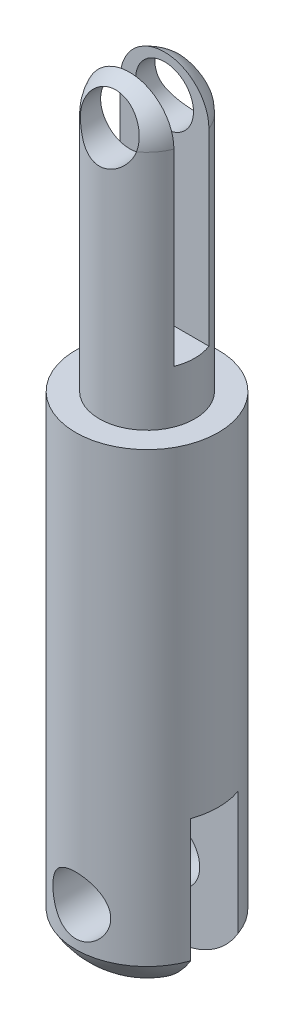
ISO-10303-21;
HEADER;
FILE_DESCRIPTION(('STEP AP214'),'2;1');
FILE_NAME('part.step','',(''),(''),'','','');
FILE_SCHEMA(('AUTOMOTIVE_DESIGN { 1 0 10303 214 1 1 1 1 }'));
ENDSEC;
DATA;
#1=APPLICATION_CONTEXT('core data for automotive mechanical design processes');
#2=APPLICATION_PROTOCOL_DEFINITION('international standard','automotive_design',2000,#1);
#3=PRODUCT_CONTEXT('',#1,'mechanical');
#4=PRODUCT('Part','Part','',(#3));
#5=PRODUCT_RELATED_PRODUCT_CATEGORY('part','',(#4));
#6=PRODUCT_DEFINITION_FORMATION('','',#4);
#7=PRODUCT_DEFINITION_CONTEXT('part definition',#1,'design');
#8=PRODUCT_DEFINITION('design','',#6,#7);
#9=PRODUCT_DEFINITION_SHAPE('','',#8);
#10=(LENGTH_UNIT() NAMED_UNIT(*) SI_UNIT(.MILLI.,.METRE.));
#11=(NAMED_UNIT(*) PLANE_ANGLE_UNIT() SI_UNIT($,.RADIAN.));
#12=(NAMED_UNIT(*) SI_UNIT($,.STERADIAN.) SOLID_ANGLE_UNIT());
#13=UNCERTAINTY_MEASURE_WITH_UNIT(LENGTH_MEASURE(1.E-05),#10,'distance_accuracy_value','');
#14=(GEOMETRIC_REPRESENTATION_CONTEXT(3) GLOBAL_UNCERTAINTY_ASSIGNED_CONTEXT((#13)) GLOBAL_UNIT_ASSIGNED_CONTEXT((#10,
#11,#12)) REPRESENTATION_CONTEXT('',''));
#15=CARTESIAN_POINT('',(0.,0.,0.));
#16=DIRECTION('',(0.,0.,1.));
#17=DIRECTION('',(1.,0.,0.));
#18=AXIS2_PLACEMENT_3D('',#15,#16,#17);
#19=CARTESIAN_POINT('',(0.,-27.1709821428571,0.));
#20=DIRECTION('',(0.,-1.,0.));
#21=DIRECTION('',(1.,0.,0.));
#22=AXIS2_PLACEMENT_3D('',#19,#20,#21);
#23=SPHERICAL_SURFACE('',#22,5.42901785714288);
#24=CARTESIAN_POINT('',(0.,-27.1709821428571,1.58));
#25=DIRECTION('',(0.,0.,1.));
#26=DIRECTION('',(0.,-1.,0.));
#27=AXIS2_PLACEMENT_3D('',#24,#25,#26);
#28=CIRCLE('',#27,5.19401914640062);
#29=CARTESIAN_POINT('',(4.47952006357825,-29.8,1.58));
#30=VERTEX_POINT('',#29);
#31=CARTESIAN_POINT('',(-4.47952006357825,-29.8,1.58));
#32=VERTEX_POINT('',#31);
#33=EDGE_CURVE('E142',#30,#32,#28,.F.);
#34=ORIENTED_EDGE('',*,*,#33,.F.);
#35=CARTESIAN_POINT('',(0.,-29.8,0.));
#36=DIRECTION('',(0.,-1.,0.));
#37=DIRECTION('',(1.,0.,0.));
#38=AXIS2_PLACEMENT_3D('',#35,#36,#37);
#39=CIRCLE('',#38,4.75000000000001);
#40=EDGE_CURVE('E258',#30,#32,#39,.T.);
#41=ORIENTED_EDGE('',*,*,#40,.T.);
#42=EDGE_LOOP('',(#34,#41));
#43=FACE_BOUND('',#42,.T.);
#44=ADVANCED_FACE('F34',(#43),#23,.T.);
#45=CARTESIAN_POINT('',(0.,-27.255,-4.75000000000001));
#46=DIRECTION('',(0.,0.,1.));
#47=DIRECTION('',(1.,0.,0.));
#48=AXIS2_PLACEMENT_3D('',#45,#46,#47);
#49=CYLINDRICAL_SURFACE('',#48,1.925);
#50=CARTESIAN_POINT('',(0.,-27.255,1.58));
#51=DIRECTION('',(0.,0.,1.));
#52=DIRECTION('',(0.,-1.,0.));
#53=AXIS2_PLACEMENT_3D('',#50,#51,#52);
#54=CIRCLE('',#53,1.925);
#55=CARTESIAN_POINT('',(0.,-29.18,1.58));
#56=VERTEX_POINT('',#55);
#57=EDGE_CURVE('E129',#56,#56,#54,.F.);
#58=ORIENTED_EDGE('',*,*,#57,.T.);
#59=EDGE_LOOP('',(#58));
#60=FACE_BOUND('',#59,.T.);
#61=CARTESIAN_POINT('',(1.925,-27.255,4.34245034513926));
#62=CARTESIAN_POINT('',(1.92498979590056,-27.152041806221,4.34246000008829));
#63=CARTESIAN_POINT('',(1.91668778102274,-27.0489042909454,4.34616503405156));
#64=CARTESIAN_POINT('',(1.88379264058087,-26.8455887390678,4.36051909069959));
#65=CARTESIAN_POINT('',(1.8591542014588,-26.7454197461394,4.37118742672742));
#66=CARTESIAN_POINT('',(1.7946866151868,-26.5513418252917,4.39804557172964));
#67=CARTESIAN_POINT('',(1.7549171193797,-26.4574099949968,4.41421367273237));
#68=CARTESIAN_POINT('',(1.66149068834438,-26.2775807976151,4.4502184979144));
#69=CARTESIAN_POINT('',(1.60783756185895,-26.1916812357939,4.47005421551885));
#70=CARTESIAN_POINT('',(1.48479243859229,-26.0252491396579,4.51246492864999));
#71=CARTESIAN_POINT('',(1.41471397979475,-25.9452467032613,4.5351295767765));
#72=CARTESIAN_POINT('',(1.26225061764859,-25.7977403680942,4.57990528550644));
#73=CARTESIAN_POINT('',(1.17986113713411,-25.730241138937,4.60201613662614));
#74=CARTESIAN_POINT('',(1.00100050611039,-25.6070060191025,4.64427256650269));
#75=CARTESIAN_POINT('',(0.904093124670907,-25.551859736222,4.66430174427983));
#76=CARTESIAN_POINT('',(0.701419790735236,-25.4588791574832,4.69904852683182));
#77=CARTESIAN_POINT('',(0.595657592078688,-25.4210375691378,4.7137683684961));
#78=CARTESIAN_POINT('',(0.383835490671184,-25.3656407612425,4.73560317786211));
#79=CARTESIAN_POINT('',(0.278049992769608,-25.3471732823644,4.74305881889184));
#80=CARTESIAN_POINT('',(0.0646364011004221,-25.3281082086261,4.75075843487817));
#81=CARTESIAN_POINT('',(-0.042990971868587,-25.3275037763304,4.75100516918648));
#82=CARTESIAN_POINT('',(-0.250426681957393,-25.3436887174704,4.74446437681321));
#83=CARTESIAN_POINT('',(-0.3503281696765,-25.359477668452,4.73808142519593));
#84=CARTESIAN_POINT('',(-0.545922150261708,-25.4062953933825,4.71954699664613));
#85=CARTESIAN_POINT('',(-0.641614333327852,-25.4373252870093,4.70739509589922));
#86=CARTESIAN_POINT('',(-0.827808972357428,-25.5141219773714,4.67827469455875));
#87=CARTESIAN_POINT('',(-0.918210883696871,-25.5601048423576,4.66123603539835));
#88=CARTESIAN_POINT('',(-1.09024990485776,-25.665296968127,4.62402568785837));
#89=CARTESIAN_POINT('',(-1.17188396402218,-25.7245108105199,4.60385291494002));
#90=CARTESIAN_POINT('',(-1.3298936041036,-25.8591169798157,4.56081498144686));
#91=CARTESIAN_POINT('',(-1.40554754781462,-25.9353289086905,4.53785998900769));
#92=CARTESIAN_POINT('',(-1.54330169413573,-26.0994361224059,4.49288129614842));
#93=CARTESIAN_POINT('',(-1.60539721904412,-26.1873354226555,4.47085791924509));
#94=CARTESIAN_POINT('',(-1.71598450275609,-26.3756326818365,4.42961549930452));
#95=CARTESIAN_POINT('',(-1.76401826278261,-26.4763239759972,4.41049897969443));
#96=CARTESIAN_POINT('',(-1.84215830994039,-26.6853472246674,4.37844239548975));
#97=CARTESIAN_POINT('',(-1.87227660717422,-26.7936740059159,4.36549819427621));
#98=CARTESIAN_POINT('',(-1.91195045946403,-27.0076833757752,4.34826258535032));
#99=CARTESIAN_POINT('',(-1.92267028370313,-27.1131101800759,4.34348230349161));
#100=CARTESIAN_POINT('',(-1.9266461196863,-27.3243416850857,4.34172139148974));
#101=CARTESIAN_POINT('',(-1.91990765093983,-27.4301462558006,4.34473829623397));
#102=CARTESIAN_POINT('',(-1.89021904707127,-27.6325488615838,4.35772903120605));
#103=CARTESIAN_POINT('',(-1.86825091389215,-27.7293213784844,4.3672810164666));
#104=CARTESIAN_POINT('',(-1.81000901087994,-27.9177379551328,4.39173741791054));
#105=CARTESIAN_POINT('',(-1.77373201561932,-28.0093808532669,4.40664304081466));
#106=CARTESIAN_POINT('',(-1.6862388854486,-28.1891444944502,4.44087662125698));
#107=CARTESIAN_POINT('',(-1.63446948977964,-28.2769651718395,4.46036130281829));
#108=CARTESIAN_POINT('',(-1.51802190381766,-28.4430796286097,4.50132369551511));
#109=CARTESIAN_POINT('',(-1.45333835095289,-28.5213694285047,4.5228022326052));
#110=CARTESIAN_POINT('',(-1.30708264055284,-28.6724030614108,4.56730809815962));
#111=CARTESIAN_POINT('',(-1.22459916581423,-28.7442697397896,4.59032873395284));
#112=CARTESIAN_POINT('',(-1.04819806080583,-28.8732844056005,4.63379142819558));
#113=CARTESIAN_POINT('',(-0.954279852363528,-28.9304316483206,4.65423335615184));
#114=CARTESIAN_POINT('',(-0.757245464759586,-29.0282175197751,4.69032019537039));
#115=CARTESIAN_POINT('',(-0.654123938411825,-29.0688464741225,4.70596229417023));
#116=CARTESIAN_POINT('',(-0.441717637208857,-29.1319029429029,4.73062243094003));
#117=CARTESIAN_POINT('',(-0.332436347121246,-29.1543406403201,4.73964417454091));
#118=CARTESIAN_POINT('',(-0.118676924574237,-29.1791461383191,4.74964188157));
#119=CARTESIAN_POINT('',(-0.0143647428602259,-29.1827530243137,4.75111446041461));
#120=CARTESIAN_POINT('',(0.193331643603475,-29.1730850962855,4.74719964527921));
#121=CARTESIAN_POINT('',(0.29671599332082,-29.1598129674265,4.74181334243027));
#122=CARTESIAN_POINT('',(0.496205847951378,-29.1176511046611,4.7250385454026));
#123=CARTESIAN_POINT('',(0.592438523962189,-29.0892776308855,4.71384875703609));
#124=CARTESIAN_POINT('',(0.778755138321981,-29.0182670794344,4.68667399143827));
#125=CARTESIAN_POINT('',(0.868837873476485,-28.9756272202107,4.67068807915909));
#126=CARTESIAN_POINT('',(1.0447128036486,-28.8751576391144,4.63459749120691));
#127=CARTESIAN_POINT('',(1.13013475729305,-28.8167355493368,4.61434098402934));
#128=CARTESIAN_POINT('',(1.29031886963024,-28.6872424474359,4.5721384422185));
#129=CARTESIAN_POINT('',(1.36507733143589,-28.616167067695,4.5501918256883));
#130=CARTESIAN_POINT('',(1.50675472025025,-28.4580332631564,4.50533699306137));
#131=CARTESIAN_POINT('',(1.57287082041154,-28.3702450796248,4.48245658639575));
#132=CARTESIAN_POINT('',(1.68952817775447,-28.1840770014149,4.4398050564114));
#133=CARTESIAN_POINT('',(1.74006096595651,-28.0856913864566,4.42003562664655));
#134=CARTESIAN_POINT('',(1.82342806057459,-27.8817195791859,4.38629992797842));
#135=CARTESIAN_POINT('',(1.85640671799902,-27.7762004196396,4.37228655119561));
#136=CARTESIAN_POINT('',(1.90377263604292,-27.5605714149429,4.35187822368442));
#137=CARTESIAN_POINT('',(1.91822227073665,-27.4504782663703,4.34545771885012));
#138=CARTESIAN_POINT('',(1.92437556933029,-27.3117481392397,4.34272581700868));
#139=CARTESIAN_POINT('',(1.92500281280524,-27.2833808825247,4.34244768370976));
#140=CARTESIAN_POINT('',(1.925,-27.255,4.34245034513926));
#141=B_SPLINE_CURVE_WITH_KNOTS('',3,(#61,#62,#63,#64,#65,#66,#67,#68,#69,#70,#71,#72,#73,#74,
#75,#76,#77,#78,#79,#80,#81,#82,#83,#84,#85,#86,#87,#88,#89,#90,#91,#92,#93,#94,#95,#96,#97,#98,
#99,#100,#101,#102,#103,#104,#105,#106,#107,#108,#109,#110,#111,#112,#113,#114,#115,#116,#117,
#118,#119,#120,#121,#122,#123,#124,#125,#126,#127,#128,#129,#130,#131,#132,#133,#134,#135,#136,
#137,#138,#139,#140),.UNSPECIFIED.,.T.,.F.,(4,2,2,2,2,2,2,2,2,2,2,2,2,2,2,2,2,2,2,2,2,2,2,2,2,2,
2,2,2,2,2,2,2,2,2,2,2,2,2,4),(0.,0.308796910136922,0.618453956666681,0.92690267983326,
1.23526687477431,1.56006696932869,1.88498812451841,2.22311526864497,2.56109978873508,
2.88233761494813,3.20345247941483,3.50606103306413,3.80869182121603,4.11590584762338,
4.42322642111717,4.7511917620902,5.07927007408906,5.41707700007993,5.75465721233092,
6.07120400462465,6.38765073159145,6.68538882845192,6.98319407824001,7.29325261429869,
7.60344017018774,7.93726343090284,8.27110357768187,8.60513896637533,8.93898724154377,
9.25056302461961,9.56208924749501,9.86359166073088,10.1651528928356,10.480156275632,
10.7952686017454,11.1304554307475,11.4658241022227,11.7983906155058,12.1298346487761,
12.2149558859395),.UNSPECIFIED.);
#142=CARTESIAN_POINT('',(1.925,-27.255,4.34245034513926));
#143=VERTEX_POINT('',#142);
#144=EDGE_CURVE('E202',#143,#143,#141,.T.);
#145=ORIENTED_EDGE('',*,*,#144,.T.);
#146=EDGE_LOOP('',(#145));
#147=FACE_BOUND('',#146,.T.);
#148=ADVANCED_FACE('F234',(#60,#147),#49,.F.);
#149=CARTESIAN_POINT('',(0.,16.025,0.));
#150=DIRECTION('',(0.,-1.,0.));
#151=DIRECTION('',(1.,0.,0.));
#152=AXIS2_PLACEMENT_3D('',#149,#150,#151);
#153=SPHERICAL_SURFACE('',#152,3.17500000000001);
#154=CARTESIAN_POINT('',(0.,16.025,1.165));
#155=DIRECTION('',(0.,0.,1.));
#156=DIRECTION('',(0.,-1.,0.));
#157=AXIS2_PLACEMENT_3D('',#154,#155,#156);
#158=CIRCLE('',#157,2.95354024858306);
#159=CARTESIAN_POINT('',(-2.95354024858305,16.025,1.165));
#160=VERTEX_POINT('',#159);
#161=CARTESIAN_POINT('',(2.95354024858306,16.025,1.165));
#162=VERTEX_POINT('',#161);
#163=EDGE_CURVE('E159',#160,#162,#158,.F.);
#164=ORIENTED_EDGE('',*,*,#163,.F.);
#165=CARTESIAN_POINT('',(0.,16.025,0.));
#166=DIRECTION('',(0.,-1.,0.));
#167=DIRECTION('',(1.,0.,0.));
#168=AXIS2_PLACEMENT_3D('',#165,#166,#167);
#169=CIRCLE('',#168,3.175);
#170=CARTESIAN_POINT('',(-1.86674181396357,16.025,2.56824843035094));
#171=VERTEX_POINT('',#170);
#172=EDGE_CURVE('E263',#171,#160,#169,.T.);
#173=ORIENTED_EDGE('',*,*,#172,.F.);
#174=CARTESIAN_POINT('',(1.86669144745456,16.0248,2.56828503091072));
#175=CARTESIAN_POINT('',(1.88016716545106,16.0783011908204,2.55849444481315));
#176=CARTESIAN_POINT('',(1.89132920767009,16.132328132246,2.54855115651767));
#177=CARTESIAN_POINT('',(1.90897692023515,16.2410898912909,2.52841389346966));
#178=CARTESIAN_POINT('',(1.91546296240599,16.2958246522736,2.51821993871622));
#179=CARTESIAN_POINT('',(1.92782323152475,16.4604150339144,2.48737422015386));
#180=CARTESIAN_POINT('',(1.92664237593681,16.5708276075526,2.46642738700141));
#181=CARTESIAN_POINT('',(1.90547891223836,16.7897752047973,2.42434624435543));
#182=CARTESIAN_POINT('',(1.8854904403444,16.898309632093,2.40321187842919));
#183=CARTESIAN_POINT('',(1.82727353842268,17.1104561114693,2.36135739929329));
#184=CARTESIAN_POINT('',(1.78904765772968,17.2140688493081,2.34063722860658));
#185=CARTESIAN_POINT('',(1.69530984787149,17.4135369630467,2.30023564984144));
#186=CARTESIAN_POINT('',(1.63977699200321,17.5093827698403,2.28055553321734));
#187=CARTESIAN_POINT('',(1.51290673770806,17.6903876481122,2.24294218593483));
#188=CARTESIAN_POINT('',(1.44156783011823,17.7755456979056,2.22500912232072));
#189=CARTESIAN_POINT('',(1.28585035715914,17.9317491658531,2.19176409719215));
#190=CARTESIAN_POINT('',(1.20161654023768,18.0029333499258,2.17642659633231));
#191=CARTESIAN_POINT('',(1.02190547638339,18.13006678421,2.14879706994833));
#192=CARTESIAN_POINT('',(0.926430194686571,18.1860186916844,2.13650451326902));
#193=CARTESIAN_POINT('',(0.7290481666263,18.2798835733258,2.11575415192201));
#194=CARTESIAN_POINT('',(0.627315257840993,18.3181456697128,2.10722230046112));
#195=CARTESIAN_POINT('',(0.418630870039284,18.3770529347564,2.09404258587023));
#196=CARTESIAN_POINT('',(0.311680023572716,18.3977002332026,2.08939425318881));
#197=CARTESIAN_POINT('',(0.0979420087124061,18.4204474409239,2.08427108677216));
#198=CARTESIAN_POINT('',(-0.00880391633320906,18.4229174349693,2.08371297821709));
#199=CARTESIAN_POINT('',(-0.221180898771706,18.4102072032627,2.08657786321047));
#200=CARTESIAN_POINT('',(-0.326812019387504,18.3950279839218,2.09000062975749));
#201=CARTESIAN_POINT('',(-0.533237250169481,18.3476798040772,2.10062096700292));
#202=CARTESIAN_POINT('',(-0.634059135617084,18.3156259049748,2.10779297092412));
#203=CARTESIAN_POINT('',(-0.828849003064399,18.2356098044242,2.12555994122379));
#204=CARTESIAN_POINT('',(-0.92281674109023,18.1876470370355,2.13615502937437));
#205=CARTESIAN_POINT('',(-1.10242983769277,18.0766281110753,2.16044394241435));
#206=CARTESIAN_POINT('',(-1.18796748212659,18.0134052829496,2.17417188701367));
#207=CARTESIAN_POINT('',(-1.34726195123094,17.8740266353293,2.20409580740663));
#208=CARTESIAN_POINT('',(-1.4210172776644,17.7978691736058,2.2202920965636));
#209=CARTESIAN_POINT('',(-1.55633593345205,17.6330062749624,2.25492345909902));
#210=CARTESIAN_POINT('',(-1.61760314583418,17.5440663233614,2.27339916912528));
#211=CARTESIAN_POINT('',(-1.72435650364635,17.3574267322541,2.31166277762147));
#212=CARTESIAN_POINT('',(-1.7698409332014,17.2597261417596,2.3314508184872));
#213=CARTESIAN_POINT('',(-1.84458660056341,17.0563273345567,2.37210311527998));
#214=CARTESIAN_POINT('',(-1.87352259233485,16.9505122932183,2.39298068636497));
#215=CARTESIAN_POINT('',(-1.91303481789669,16.7355358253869,2.43483761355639));
#216=CARTESIAN_POINT('',(-1.92361635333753,16.6263753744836,2.45581693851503));
#217=CARTESIAN_POINT('',(-1.92582563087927,16.4342820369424,2.49227249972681));
#218=CARTESIAN_POINT('',(-1.92141936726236,16.351392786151,2.50785222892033));
#219=CARTESIAN_POINT('',(-1.90198579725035,16.1868629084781,2.53850083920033));
#220=CARTESIAN_POINT('',(-1.88696930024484,16.1052210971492,2.55357022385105));
#221=CARTESIAN_POINT('',(-1.86669144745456,16.0248,2.56828503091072));
#222=B_SPLINE_CURVE_WITH_KNOTS('',3,(#174,#175,#176,#177,#178,#179,#180,#181,#182,#183,#184,
#185,#186,#187,#188,#189,#190,#191,#192,#193,#194,#195,#196,#197,#198,#199,#200,#201,#202,#203,
#204,#205,#206,#207,#208,#209,#210,#211,#212,#213,#214,#215,#216,#217,#218,#219,#220,#221),
.UNSPECIFIED.,.F.,.F.,(4,2,2,2,2,2,2,2,2,2,2,2,2,2,2,2,2,2,2,2,2,2,2,4),(0.,0.167997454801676,
0.335981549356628,0.671419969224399,1.0069630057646,1.34245915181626,1.67836254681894,
2.01429802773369,2.3467069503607,2.67905784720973,3.00453560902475,3.32997401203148,
3.64876776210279,3.96754333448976,4.28417293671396,4.60081380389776,4.92108333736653,
5.24139356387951,5.56858828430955,5.89581856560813,6.22927689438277,6.56263888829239,
6.81535443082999,7.06781288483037),.UNSPECIFIED.);
#223=CARTESIAN_POINT('',(1.86674181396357,16.025,2.56824843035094));
#224=VERTEX_POINT('',#223);
#225=EDGE_CURVE('E197',#224,#171,#222,.T.);
#226=ORIENTED_EDGE('',*,*,#225,.F.);
#227=EDGE_CURVE('E259',#162,#224,#169,.T.);
#228=ORIENTED_EDGE('',*,*,#227,.F.);
#229=EDGE_LOOP('',(#164,#173,#226,#228));
#230=FACE_BOUND('',#229,.T.);
#231=ADVANCED_FACE('F212',(#230),#153,.T.);
#232=CARTESIAN_POINT('',(0.,16.495,-4.75000000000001));
#233=DIRECTION('',(0.,0.,1.));
#234=DIRECTION('',(1.,0.,0.));
#235=AXIS2_PLACEMENT_3D('',#232,#233,#234);
#236=CYLINDRICAL_SURFACE('',#235,1.925);
#237=CARTESIAN_POINT('',(0.,16.495,1.165));
#238=DIRECTION('',(0.,0.,1.));
#239=DIRECTION('',(0.,-1.,0.));
#240=AXIS2_PLACEMENT_3D('',#237,#238,#239);
#241=CIRCLE('',#240,1.925);
#242=CARTESIAN_POINT('',(0.,14.57,1.165));
#243=VERTEX_POINT('',#242);
#244=EDGE_CURVE('E158',#243,#243,#241,.F.);
#245=ORIENTED_EDGE('',*,*,#244,.T.);
#246=EDGE_LOOP('',(#245));
#247=FACE_BOUND('',#246,.T.);
#248=CARTESIAN_POINT('',(1.925,16.495,2.52487623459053));
#249=CARTESIAN_POINT('',(1.9249941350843,16.5913960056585,2.52488512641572));
#250=CARTESIAN_POINT('',(1.91769399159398,16.687972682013,2.53049768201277));
#251=CARTESIAN_POINT('',(1.88898525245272,16.8779556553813,2.5519911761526));
#252=CARTESIAN_POINT('',(1.86753338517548,16.9713513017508,2.56790360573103));
#253=CARTESIAN_POINT('',(1.81198030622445,17.1516445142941,2.60739148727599));
#254=CARTESIAN_POINT('',(1.77798318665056,17.2385886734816,2.63090368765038));
#255=CARTESIAN_POINT('',(1.69861141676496,17.4054336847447,2.68283228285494));
#256=CARTESIAN_POINT('',(1.65323776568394,17.4853351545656,2.71124824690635));
#257=CARTESIAN_POINT('',(1.54576659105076,17.6468604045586,2.77408889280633));
#258=CARTESIAN_POINT('',(1.48228575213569,17.7274448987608,2.80882029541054));
#259=CARTESIAN_POINT('',(1.34323115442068,17.8776945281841,2.87791464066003));
#260=CARTESIAN_POINT('',(1.26764733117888,17.9473504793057,2.9122772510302));
#261=CARTESIAN_POINT('',(1.09635956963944,18.0814157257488,2.98128391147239));
#262=CARTESIAN_POINT('',(0.999353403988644,18.1443834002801,3.01553546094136));
#263=CARTESIAN_POINT('',(0.79365270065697,18.2526136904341,3.0760677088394));
#264=CARTESIAN_POINT('',(0.684969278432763,18.2978929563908,3.10235589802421));
#265=CARTESIAN_POINT('',(0.470132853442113,18.3647587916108,3.1417102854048));
#266=CARTESIAN_POINT('',(0.364757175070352,18.3882176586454,3.15581174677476));
#267=CARTESIAN_POINT('',(0.150721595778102,18.4171174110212,3.17323097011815));
#268=CARTESIAN_POINT('',(0.0420649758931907,18.4225757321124,3.1765591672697));
#269=CARTESIAN_POINT('',(-0.160609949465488,18.4156223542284,3.17234825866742));
#270=CARTESIAN_POINT('',(-0.254740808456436,18.4053844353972,3.16613095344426));
#271=CARTESIAN_POINT('',(-0.43965285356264,18.3714767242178,3.1457877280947));
#272=CARTESIAN_POINT('',(-0.530433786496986,18.3478059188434,3.13166121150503));
#273=CARTESIAN_POINT('',(-0.706863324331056,18.2879582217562,3.09662877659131));
#274=CARTESIAN_POINT('',(-0.792483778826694,18.2517189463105,3.07568907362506));
#275=CARTESIAN_POINT('',(-0.956524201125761,18.1680727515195,3.02869222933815));
#276=CARTESIAN_POINT('',(-1.03494235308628,18.1206630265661,3.00263380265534));
#277=CARTESIAN_POINT('',(-1.19250605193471,18.0095749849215,2.94388320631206));
#278=CARTESIAN_POINT('',(-1.27059585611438,17.9446234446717,2.91076995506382));
#279=CARTESIAN_POINT('',(-1.41544054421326,17.8035840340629,2.84315987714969));
#280=CARTESIAN_POINT('',(-1.482179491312,17.7274807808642,2.80866118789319));
#281=CARTESIAN_POINT('',(-1.61050421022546,17.5555424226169,2.73731696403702));
#282=CARTESIAN_POINT('',(-1.67051981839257,17.4584360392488,2.7006839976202));
#283=CARTESIAN_POINT('',(-1.77307627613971,17.2532335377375,2.63449602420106));
#284=CARTESIAN_POINT('',(-1.81564942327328,17.1451581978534,2.60492797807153));
#285=CARTESIAN_POINT('',(-1.87276555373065,16.9489063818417,2.56403650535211));
#286=CARTESIAN_POINT('',(-1.89166619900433,16.8625661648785,2.54999433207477));
#287=CARTESIAN_POINT('',(-1.91742547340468,16.6871843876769,2.53068678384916));
#288=CARTESIAN_POINT('',(-1.92429869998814,16.598146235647,2.52541076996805));
#289=CARTESIAN_POINT('',(-1.9255999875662,16.4197843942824,2.52441893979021));
#290=CARTESIAN_POINT('',(-1.92000821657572,16.330460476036,2.52871835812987));
#291=CARTESIAN_POINT('',(-1.89669466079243,16.1542879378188,2.54624756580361));
#292=CARTESIAN_POINT('',(-1.87896314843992,16.067441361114,2.55948451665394));
#293=CARTESIAN_POINT('',(-1.83241038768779,15.8987390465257,2.59301066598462));
#294=CARTESIAN_POINT('',(-1.80364274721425,15.8168613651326,2.61326572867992));
#295=CARTESIAN_POINT('',(-1.73604919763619,15.6588464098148,2.65864862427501));
#296=CARTESIAN_POINT('',(-1.69721955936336,15.582711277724,2.68377826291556));
#297=CARTESIAN_POINT('',(-1.60241340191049,15.4235639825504,2.74162555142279));
#298=CARTESIAN_POINT('',(-1.54459920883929,15.3418441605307,2.77489015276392));
#299=CARTESIAN_POINT('',(-1.41717669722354,15.1884031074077,2.84208265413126));
#300=CARTESIAN_POINT('',(-1.34755681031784,15.1166918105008,2.87601117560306));
#301=CARTESIAN_POINT('',(-1.18710252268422,14.9753453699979,2.94619852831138));
#302=CARTESIAN_POINT('',(-1.09466775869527,14.9073474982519,2.98213759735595));
#303=CARTESIAN_POINT('',(-0.89741141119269,14.7880932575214,3.04730023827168));
#304=CARTESIAN_POINT('',(-0.792597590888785,14.7368264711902,3.07652798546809));
#305=CARTESIAN_POINT('',(-0.580981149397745,14.6565292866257,3.12313683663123));
#306=CARTESIAN_POINT('',(-0.474830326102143,14.6261944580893,3.14120352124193));
#307=CARTESIAN_POINT('',(-0.257685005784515,14.5841334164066,3.16640469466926));
#308=CARTESIAN_POINT('',(-0.146696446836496,14.5723850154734,3.17355221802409));
#309=CARTESIAN_POINT('',(0.0604573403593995,14.5685517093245,3.17587962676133));
#310=CARTESIAN_POINT('',(0.156570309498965,14.5739935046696,3.17256486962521));
#311=CARTESIAN_POINT('',(0.346254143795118,14.5989831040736,3.1574957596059));
#312=CARTESIAN_POINT('',(0.439825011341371,14.6185308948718,3.1457414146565));
#313=CARTESIAN_POINT('',(0.620028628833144,14.6702242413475,3.11518608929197));
#314=CARTESIAN_POINT('',(0.706764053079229,14.7021043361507,3.09653393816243));
#315=CARTESIAN_POINT('',(0.873647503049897,14.7772263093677,3.05365299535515));
#316=CARTESIAN_POINT('',(0.953794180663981,14.8204705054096,3.02942306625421));
#317=CARTESIAN_POINT('',(1.11454297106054,14.9222881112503,2.97428882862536));
#318=CARTESIAN_POINT('',(1.19426506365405,14.9820106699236,2.9429467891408));
#319=CARTESIAN_POINT('',(1.34317079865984,15.1124894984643,2.87804275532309));
#320=CARTESIAN_POINT('',(1.4123420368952,15.1832585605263,2.84447821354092));
#321=CARTESIAN_POINT('',(1.54754282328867,15.3446788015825,2.77349899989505));
#322=CARTESIAN_POINT('',(1.61196134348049,15.4367208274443,2.73615885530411));
#323=CARTESIAN_POINT('',(1.72445971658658,15.6321350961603,2.66669173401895));
#324=CARTESIAN_POINT('',(1.77255226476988,15.7354984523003,2.6345607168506));
#325=CARTESIAN_POINT('',(1.84156017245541,15.927345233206,2.58662673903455));
#326=CARTESIAN_POINT('',(1.86614592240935,16.0139986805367,2.56877995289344));
#327=CARTESIAN_POINT('',(1.90298381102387,16.1910418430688,2.54161738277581));
#328=CARTESIAN_POINT('',(1.91527697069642,16.2814180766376,2.5322732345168));
#329=CARTESIAN_POINT('',(1.92239040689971,16.3927159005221,2.52686354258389));
#330=CARTESIAN_POINT('',(1.9233678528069,16.4131498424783,2.52611997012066));
#331=CARTESIAN_POINT('',(1.92467332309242,16.4540531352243,2.52512533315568));
#332=CARTESIAN_POINT('',(1.92500124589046,16.4745224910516,2.52487434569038));
#333=CARTESIAN_POINT('',(1.925,16.495,2.52487623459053));
#334=B_SPLINE_CURVE_WITH_KNOTS('',3,(#248,#249,#250,#251,#252,#253,#254,#255,#256,#257,#258,
#259,#260,#261,#262,#263,#264,#265,#266,#267,#268,#269,#270,#271,#272,#273,#274,#275,#276,#277,
#278,#279,#280,#281,#282,#283,#284,#285,#286,#287,#288,#289,#290,#291,#292,#293,#294,#295,#296,
#297,#298,#299,#300,#301,#302,#303,#304,#305,#306,#307,#308,#309,#310,#311,#312,#313,#314,#315,
#316,#317,#318,#319,#320,#321,#322,#323,#324,#325,#326,#327,#328,#329,#330,#331,#332,#333),
.UNSPECIFIED.,.T.,.F.,(4,2,2,2,2,2,2,2,2,2,2,2,2,2,2,2,2,2,2,2,2,2,2,2,2,2,2,2,2,2,2,2,2,2,2,2,
2,2,2,2,2,2,4),(0.,0.289093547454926,0.579075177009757,0.866702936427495,1.1543054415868,
1.47795445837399,1.80187402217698,2.16176446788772,2.52131532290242,2.84598639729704,
3.17034289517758,3.4536571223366,3.73699271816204,4.02175527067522,4.30658942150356,
4.62582034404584,4.94549583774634,5.30339239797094,5.66062322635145,5.92796061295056,
6.19497331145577,6.46241113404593,6.73006350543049,6.99643189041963,7.26289913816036,
7.57814446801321,7.89370050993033,8.2525876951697,8.61125099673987,8.94482952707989,
9.27800954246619,9.5655457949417,9.85308177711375,10.1347449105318,10.4164655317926,
10.7285178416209,11.0409342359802,11.3944592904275,11.7477088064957,12.0220927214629,
12.295557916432,12.3569607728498,12.4183732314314),.UNSPECIFIED.);
#335=EDGE_CURVE('E171',#171,#224,#334,.T.);
#336=ORIENTED_EDGE('',*,*,#335,.T.);
#337=ORIENTED_EDGE('',*,*,#225,.T.);
#338=EDGE_LOOP('',(#336,#337));
#339=FACE_BOUND('',#338,.T.);
#340=ADVANCED_FACE('F183',(#247,#339),#236,.F.);
#341=CARTESIAN_POINT('',(0.,-32.6,0.));
#342=DIRECTION('',(0.,-1.,0.));
#343=DIRECTION('',(1.,0.,0.));
#344=AXIS2_PLACEMENT_3D('',#341,#342,#343);
#345=CYLINDRICAL_SURFACE('',#344,3.17500000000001);
#346=DIRECTION('',(0.,-1.,0.));
#347=VECTOR('',#346,1.);
#348=CARTESIAN_POINT('',(-2.95354024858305,-32.6,1.16499999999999));
#349=LINE('',#348,#347);
#350=CARTESIAN_POINT('',(-2.95354024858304,3.5,1.165));
#351=VERTEX_POINT('',#350);
#352=EDGE_CURVE('E163',#351,#160,#349,.F.);
#353=ORIENTED_EDGE('',*,*,#352,.F.);
#354=CARTESIAN_POINT('',(0.,3.5,0.));
#355=DIRECTION('',(0.,-1.,0.));
#356=DIRECTION('',(0.,0.,-1.));
#357=AXIS2_PLACEMENT_3D('',#354,#355,#356);
#358=CIRCLE('',#357,3.17500000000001);
#359=CARTESIAN_POINT('',(-2.95354024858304,3.5,-1.165));
#360=VERTEX_POINT('',#359);
#361=EDGE_CURVE('E124',#360,#351,#358,.F.);
#362=ORIENTED_EDGE('',*,*,#361,.F.);
#363=DIRECTION('',(0.,-1.,0.));
#364=VECTOR('',#363,1.);
#365=CARTESIAN_POINT('',(-2.95354024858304,-32.6,-1.16500000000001));
#366=LINE('',#365,#364);
#367=CARTESIAN_POINT('',(-2.95354024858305,16.025,-1.165));
#368=VERTEX_POINT('',#367);
#369=EDGE_CURVE('E155',#368,#360,#366,.T.);
#370=ORIENTED_EDGE('',*,*,#369,.F.);
#371=CARTESIAN_POINT('',(-1.86674181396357,16.025,-2.56824843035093));
#372=VERTEX_POINT('',#371);
#373=EDGE_CURVE('E264',#368,#372,#169,.T.);
#374=ORIENTED_EDGE('',*,*,#373,.T.);
#375=CARTESIAN_POINT('',(1.925,16.495,-2.52487623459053));
#376=CARTESIAN_POINT('',(1.9249941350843,16.3986039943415,-2.52488512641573));
#377=CARTESIAN_POINT('',(1.91769399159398,16.302027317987,-2.53049768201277));
#378=CARTESIAN_POINT('',(1.88898525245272,16.1120443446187,-2.5519911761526));
#379=CARTESIAN_POINT('',(1.86753338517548,16.0186486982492,-2.56790360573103));
#380=CARTESIAN_POINT('',(1.81198030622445,15.8383554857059,-2.60739148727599));
#381=CARTESIAN_POINT('',(1.77798318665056,15.7514113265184,-2.63090368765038));
#382=CARTESIAN_POINT('',(1.69861141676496,15.5845663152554,-2.68283228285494));
#383=CARTESIAN_POINT('',(1.65323776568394,15.5046648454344,-2.71124824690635));
#384=CARTESIAN_POINT('',(1.54576659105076,15.3431395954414,-2.77408889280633));
#385=CARTESIAN_POINT('',(1.48228575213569,15.2625551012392,-2.80882029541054));
#386=CARTESIAN_POINT('',(1.34323115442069,15.1123054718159,-2.87791464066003));
#387=CARTESIAN_POINT('',(1.26764733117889,15.0426495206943,-2.9122772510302));
#388=CARTESIAN_POINT('',(1.09635956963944,14.9085842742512,-2.98128391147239));
#389=CARTESIAN_POINT('',(0.999353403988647,14.8456165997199,-3.01553546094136));
#390=CARTESIAN_POINT('',(0.793652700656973,14.7373863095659,-3.0760677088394));
#391=CARTESIAN_POINT('',(0.684969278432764,14.6921070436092,-3.10235589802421));
#392=CARTESIAN_POINT('',(0.470132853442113,14.6252412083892,-3.1417102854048));
#393=CARTESIAN_POINT('',(0.364757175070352,14.6017823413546,-3.15581174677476));
#394=CARTESIAN_POINT('',(0.150721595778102,14.5728825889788,-3.17323097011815));
#395=CARTESIAN_POINT('',(0.0420649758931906,14.5674242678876,-3.1765591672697));
#396=CARTESIAN_POINT('',(-0.160609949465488,14.5743776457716,-3.17234825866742));
#397=CARTESIAN_POINT('',(-0.254740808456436,14.5846155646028,-3.16613095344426));
#398=CARTESIAN_POINT('',(-0.43965285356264,14.6185232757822,-3.1457877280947));
#399=CARTESIAN_POINT('',(-0.530433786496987,14.6421940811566,-3.13166121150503));
#400=CARTESIAN_POINT('',(-0.706863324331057,14.7020417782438,-3.09662877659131));
#401=CARTESIAN_POINT('',(-0.792483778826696,14.7382810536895,-3.07568907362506));
#402=CARTESIAN_POINT('',(-0.956524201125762,14.8219272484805,-3.02869222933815));
#403=CARTESIAN_POINT('',(-1.03494235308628,14.8693369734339,-3.00263380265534));
#404=CARTESIAN_POINT('',(-1.19250605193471,14.9804250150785,-2.94388320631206));
#405=CARTESIAN_POINT('',(-1.27059585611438,15.0453765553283,-2.91076995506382));
#406=CARTESIAN_POINT('',(-1.41544054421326,15.1864159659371,-2.84315987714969));
#407=CARTESIAN_POINT('',(-1.482179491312,15.2625192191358,-2.80866118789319));
#408=CARTESIAN_POINT('',(-1.61050421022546,15.4344575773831,-2.73731696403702));
#409=CARTESIAN_POINT('',(-1.67051981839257,15.5315639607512,-2.7006839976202));
#410=CARTESIAN_POINT('',(-1.77307627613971,15.7367664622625,-2.63449602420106));
#411=CARTESIAN_POINT('',(-1.81564942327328,15.8448418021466,-2.60492797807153));
#412=CARTESIAN_POINT('',(-1.87276555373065,16.0410936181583,-2.56403650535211));
#413=CARTESIAN_POINT('',(-1.89166619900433,16.1274338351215,-2.54999433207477));
#414=CARTESIAN_POINT('',(-1.91742547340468,16.3028156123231,-2.53068678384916));
#415=CARTESIAN_POINT('',(-1.92429869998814,16.391853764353,-2.52541076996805));
#416=CARTESIAN_POINT('',(-1.9255999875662,16.5702156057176,-2.52441893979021));
#417=CARTESIAN_POINT('',(-1.92000821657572,16.659539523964,-2.52871835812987));
#418=CARTESIAN_POINT('',(-1.89669466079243,16.8357120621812,-2.54624756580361));
#419=CARTESIAN_POINT('',(-1.87896314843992,16.922558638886,-2.55948451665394));
#420=CARTESIAN_POINT('',(-1.83241038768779,17.0912609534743,-2.59301066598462));
#421=CARTESIAN_POINT('',(-1.80364274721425,17.1731386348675,-2.61326572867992));
#422=CARTESIAN_POINT('',(-1.73604919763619,17.3311535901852,-2.65864862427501));
#423=CARTESIAN_POINT('',(-1.69721955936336,17.407288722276,-2.68377826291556));
#424=CARTESIAN_POINT('',(-1.60241340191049,17.5664360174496,-2.74162555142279));
#425=CARTESIAN_POINT('',(-1.5445992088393,17.6481558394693,-2.77489015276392));
#426=CARTESIAN_POINT('',(-1.41717669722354,17.8015968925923,-2.84208265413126));
#427=CARTESIAN_POINT('',(-1.34755681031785,17.8733081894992,-2.87601117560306));
#428=CARTESIAN_POINT('',(-1.18710252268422,18.0146546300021,-2.94619852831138));
#429=CARTESIAN_POINT('',(-1.09466775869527,18.0826525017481,-2.98213759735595));
#430=CARTESIAN_POINT('',(-0.897411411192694,18.2019067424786,-3.04730023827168));
#431=CARTESIAN_POINT('',(-0.792597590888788,18.2531735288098,-3.07652798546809));
#432=CARTESIAN_POINT('',(-0.580981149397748,18.3334707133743,-3.12313683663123));
#433=CARTESIAN_POINT('',(-0.474830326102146,18.3638055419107,-3.14120352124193));
#434=CARTESIAN_POINT('',(-0.257685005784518,18.4058665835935,-3.16640469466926));
#435=CARTESIAN_POINT('',(-0.1466964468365,18.4176149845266,-3.17355221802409));
#436=CARTESIAN_POINT('',(0.0604573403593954,18.4214482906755,-3.17587962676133));
#437=CARTESIAN_POINT('',(0.156570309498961,18.4160064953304,-3.17256486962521));
#438=CARTESIAN_POINT('',(0.346254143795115,18.3910168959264,-3.1574957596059));
#439=CARTESIAN_POINT('',(0.439825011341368,18.3714691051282,-3.14574141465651));
#440=CARTESIAN_POINT('',(0.620028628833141,18.3197757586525,-3.11518608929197));
#441=CARTESIAN_POINT('',(0.706764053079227,18.2878956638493,-3.09653393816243));
#442=CARTESIAN_POINT('',(0.873647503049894,18.2127736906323,-3.05365299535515));
#443=CARTESIAN_POINT('',(0.953794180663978,18.1695294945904,-3.02942306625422));
#444=CARTESIAN_POINT('',(1.11454297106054,18.0677118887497,-2.97428882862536));
#445=CARTESIAN_POINT('',(1.19426506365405,18.0079893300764,-2.9429467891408));
#446=CARTESIAN_POINT('',(1.34317079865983,17.8775105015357,-2.87804275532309));
#447=CARTESIAN_POINT('',(1.41234203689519,17.8067414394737,-2.84447821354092));
#448=CARTESIAN_POINT('',(1.54754282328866,17.6453211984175,-2.77349899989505));
#449=CARTESIAN_POINT('',(1.61196134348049,17.5532791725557,-2.73615885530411));
#450=CARTESIAN_POINT('',(1.72445971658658,17.3578649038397,-2.66669173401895));
#451=CARTESIAN_POINT('',(1.77255226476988,17.2545015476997,-2.6345607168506));
#452=CARTESIAN_POINT('',(1.84156017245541,17.062654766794,-2.58662673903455));
#453=CARTESIAN_POINT('',(1.86614592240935,16.9760013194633,-2.56877995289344));
#454=CARTESIAN_POINT('',(1.90298381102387,16.7989581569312,-2.54161738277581));
#455=CARTESIAN_POINT('',(1.91527697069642,16.7085819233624,-2.5322732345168));
#456=CARTESIAN_POINT('',(1.92239040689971,16.5972840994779,-2.52686354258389));
#457=CARTESIAN_POINT('',(1.9233678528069,16.5768501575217,-2.52611997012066));
#458=CARTESIAN_POINT('',(1.92467332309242,16.5359468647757,-2.52512533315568));
#459=CARTESIAN_POINT('',(1.92500124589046,16.5154775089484,-2.52487434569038));
#460=CARTESIAN_POINT('',(1.925,16.495,-2.52487623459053));
#461=B_SPLINE_CURVE_WITH_KNOTS('',3,(#375,#376,#377,#378,#379,#380,#381,#382,#383,#384,#385,
#386,#387,#388,#389,#390,#391,#392,#393,#394,#395,#396,#397,#398,#399,#400,#401,#402,#403,#404,
#405,#406,#407,#408,#409,#410,#411,#412,#413,#414,#415,#416,#417,#418,#419,#420,#421,#422,#423,
#424,#425,#426,#427,#428,#429,#430,#431,#432,#433,#434,#435,#436,#437,#438,#439,#440,#441,#442,
#443,#444,#445,#446,#447,#448,#449,#450,#451,#452,#453,#454,#455,#456,#457,#458,#459,#460),
.UNSPECIFIED.,.T.,.F.,(4,2,2,2,2,2,2,2,2,2,2,2,2,2,2,2,2,2,2,2,2,2,2,2,2,2,2,2,2,2,2,2,2,2,2,2,
2,2,2,2,2,2,4),(0.,0.289093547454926,0.579075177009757,0.866702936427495,1.1543054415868,
1.47795445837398,1.80187402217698,2.16176446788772,2.52131532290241,2.84598639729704,
3.17034289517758,3.4536571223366,3.73699271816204,4.02175527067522,4.30658942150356,
4.62582034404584,4.94549583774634,5.30339239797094,5.66062322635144,5.92796061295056,
6.19497331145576,6.46241113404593,6.73006350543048,6.99643189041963,7.26289913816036,
7.5781444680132,7.89370050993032,8.25258769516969,8.61125099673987,8.94482952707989,
9.27800954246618,9.56554579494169,9.85308177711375,10.1347449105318,10.4164655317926,
10.7285178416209,11.0409342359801,11.3944592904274,11.7477088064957,12.0220927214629,
12.295557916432,12.3569607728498,12.4183732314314),.UNSPECIFIED.);
#462=CARTESIAN_POINT('',(1.86674181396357,16.025,-2.56824843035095));
#463=VERTEX_POINT('',#462);
#464=EDGE_CURVE('E165',#463,#372,#461,.T.);
#465=ORIENTED_EDGE('',*,*,#464,.F.);
#466=CARTESIAN_POINT('',(2.95354024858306,16.025,-1.165));
#467=VERTEX_POINT('',#466);
#468=EDGE_CURVE('E262',#463,#467,#169,.T.);
#469=ORIENTED_EDGE('',*,*,#468,.T.);
#470=DIRECTION('',(0.,-1.,0.));
#471=VECTOR('',#470,1.);
#472=CARTESIAN_POINT('',(2.95354024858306,-32.6,-1.16500000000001));
#473=LINE('',#472,#471);
#474=CARTESIAN_POINT('',(2.95354024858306,3.5,-1.165));
#475=VERTEX_POINT('',#474);
#476=EDGE_CURVE('E57',#475,#467,#473,.F.);
#477=ORIENTED_EDGE('',*,*,#476,.F.);
#478=CARTESIAN_POINT('',(2.95354024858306,3.5,1.165));
#479=VERTEX_POINT('',#478);
#480=EDGE_CURVE('E224',#479,#475,#358,.F.);
#481=ORIENTED_EDGE('',*,*,#480,.F.);
#482=DIRECTION('',(0.,-1.,0.));
#483=VECTOR('',#482,1.);
#484=CARTESIAN_POINT('',(2.95354024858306,-32.6,1.16499999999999));
#485=LINE('',#484,#483);
#486=EDGE_CURVE('E161',#162,#479,#485,.T.);
#487=ORIENTED_EDGE('',*,*,#486,.F.);
#488=ORIENTED_EDGE('',*,*,#227,.T.);
#489=ORIENTED_EDGE('',*,*,#335,.F.);
#490=ORIENTED_EDGE('',*,*,#172,.T.);
#491=EDGE_LOOP('',(#353,#362,#370,#374,#465,#469,#477,#481,#487,#488,#489,#490));
#492=FACE_BOUND('',#491,.T.);
#493=CARTESIAN_POINT('',(0.,0.,0.));
#494=DIRECTION('',(0.,-1.,0.));
#495=DIRECTION('',(1.,0.,0.));
#496=AXIS2_PLACEMENT_3D('',#493,#494,#495);
#497=CIRCLE('',#496,3.17500000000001);
#498=CARTESIAN_POINT('',(3.17500000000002,0.,0.));
#499=VERTEX_POINT('',#498);
#500=EDGE_CURVE('E295',#499,#499,#497,.T.);
#501=ORIENTED_EDGE('',*,*,#500,.F.);
#502=EDGE_LOOP('',(#501));
#503=FACE_BOUND('',#502,.T.);
#504=ADVANCED_FACE('F36',(#492,#503),#345,.T.);
#505=CARTESIAN_POINT('',(0.,16.025,-1.165));
#506=DIRECTION('',(0.,0.,-1.));
#507=DIRECTION('',(0.,1.,0.));
#508=AXIS2_PLACEMENT_3D('',#505,#506,#507);
#509=CIRCLE('',#508,2.95354024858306);
#510=EDGE_CURVE('E153',#467,#368,#509,.F.);
#511=ORIENTED_EDGE('',*,*,#510,.F.);
#512=ORIENTED_EDGE('',*,*,#468,.F.);
#513=CARTESIAN_POINT('',(-1.86669144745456,16.0248,-2.56828503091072));
#514=CARTESIAN_POINT('',(-1.88016716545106,16.0783011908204,-2.55849444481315));
#515=CARTESIAN_POINT('',(-1.89132920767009,16.132328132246,-2.54855115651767));
#516=CARTESIAN_POINT('',(-1.90897692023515,16.2410898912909,-2.52841389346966));
#517=CARTESIAN_POINT('',(-1.91546296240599,16.2958246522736,-2.51821993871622));
#518=CARTESIAN_POINT('',(-1.92782323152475,16.4604150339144,-2.48737422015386));
#519=CARTESIAN_POINT('',(-1.92664237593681,16.5708276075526,-2.46642738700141));
#520=CARTESIAN_POINT('',(-1.90547891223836,16.7897752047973,-2.42434624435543));
#521=CARTESIAN_POINT('',(-1.8854904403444,16.898309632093,-2.40321187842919));
#522=CARTESIAN_POINT('',(-1.82727353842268,17.1104561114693,-2.36135739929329));
#523=CARTESIAN_POINT('',(-1.78904765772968,17.2140688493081,-2.34063722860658));
#524=CARTESIAN_POINT('',(-1.69530984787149,17.4135369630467,-2.30023564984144));
#525=CARTESIAN_POINT('',(-1.63977699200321,17.5093827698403,-2.28055553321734));
#526=CARTESIAN_POINT('',(-1.51290673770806,17.6903876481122,-2.24294218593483));
#527=CARTESIAN_POINT('',(-1.44156783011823,17.7755456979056,-2.22500912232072));
#528=CARTESIAN_POINT('',(-1.28585035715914,17.9317491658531,-2.19176409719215));
#529=CARTESIAN_POINT('',(-1.20161654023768,18.0029333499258,-2.17642659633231));
#530=CARTESIAN_POINT('',(-1.02190547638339,18.13006678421,-2.14879706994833));
#531=CARTESIAN_POINT('',(-0.926430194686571,18.1860186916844,-2.13650451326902));
#532=CARTESIAN_POINT('',(-0.7290481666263,18.2798835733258,-2.11575415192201));
#533=CARTESIAN_POINT('',(-0.627315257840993,18.3181456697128,-2.10722230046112));
#534=CARTESIAN_POINT('',(-0.418630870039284,18.3770529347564,-2.09404258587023));
#535=CARTESIAN_POINT('',(-0.311680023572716,18.3977002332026,-2.08939425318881));
#536=CARTESIAN_POINT('',(-0.0979420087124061,18.4204474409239,-2.08427108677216));
#537=CARTESIAN_POINT('',(0.00880391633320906,18.4229174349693,-2.08371297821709));
#538=CARTESIAN_POINT('',(0.221180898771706,18.4102072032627,-2.08657786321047));
#539=CARTESIAN_POINT('',(0.326812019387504,18.3950279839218,-2.09000062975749));
#540=CARTESIAN_POINT('',(0.533237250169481,18.3476798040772,-2.10062096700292));
#541=CARTESIAN_POINT('',(0.634059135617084,18.3156259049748,-2.10779297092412));
#542=CARTESIAN_POINT('',(0.828849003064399,18.2356098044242,-2.12555994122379));
#543=CARTESIAN_POINT('',(0.92281674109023,18.1876470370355,-2.13615502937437));
#544=CARTESIAN_POINT('',(1.10242983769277,18.0766281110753,-2.16044394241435));
#545=CARTESIAN_POINT('',(1.18796748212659,18.0134052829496,-2.17417188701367));
#546=CARTESIAN_POINT('',(1.34726195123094,17.8740266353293,-2.20409580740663));
#547=CARTESIAN_POINT('',(1.4210172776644,17.7978691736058,-2.2202920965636));
#548=CARTESIAN_POINT('',(1.55633593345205,17.6330062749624,-2.25492345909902));
#549=CARTESIAN_POINT('',(1.61760314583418,17.5440663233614,-2.27339916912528));
#550=CARTESIAN_POINT('',(1.72435650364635,17.3574267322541,-2.31166277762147));
#551=CARTESIAN_POINT('',(1.7698409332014,17.2597261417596,-2.3314508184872));
#552=CARTESIAN_POINT('',(1.84458660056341,17.0563273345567,-2.37210311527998));
#553=CARTESIAN_POINT('',(1.87352259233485,16.9505122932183,-2.39298068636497));
#554=CARTESIAN_POINT('',(1.91303481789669,16.7355358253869,-2.43483761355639));
#555=CARTESIAN_POINT('',(1.92361635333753,16.6263753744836,-2.45581693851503));
#556=CARTESIAN_POINT('',(1.92582563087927,16.4342820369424,-2.49227249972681));
#557=CARTESIAN_POINT('',(1.92141936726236,16.351392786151,-2.50785222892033));
#558=CARTESIAN_POINT('',(1.90198579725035,16.1868629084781,-2.53850083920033));
#559=CARTESIAN_POINT('',(1.88696930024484,16.1052210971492,-2.55357022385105));
#560=CARTESIAN_POINT('',(1.86669144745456,16.0248,-2.56828503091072));
#561=B_SPLINE_CURVE_WITH_KNOTS('',3,(#513,#514,#515,#516,#517,#518,#519,#520,#521,#522,#523,
#524,#525,#526,#527,#528,#529,#530,#531,#532,#533,#534,#535,#536,#537,#538,#539,#540,#541,#542,
#543,#544,#545,#546,#547,#548,#549,#550,#551,#552,#553,#554,#555,#556,#557,#558,#559,#560),
.UNSPECIFIED.,.F.,.F.,(4,2,2,2,2,2,2,2,2,2,2,2,2,2,2,2,2,2,2,2,2,2,2,4),(0.,0.167997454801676,
0.335981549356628,0.671419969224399,1.0069630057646,1.34245915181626,1.67836254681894,
2.01429802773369,2.3467069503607,2.67905784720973,3.00453560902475,3.32997401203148,
3.64876776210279,3.96754333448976,4.28417293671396,4.60081380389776,4.92108333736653,
5.24139356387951,5.56858828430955,5.89581856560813,6.22927689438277,6.56263888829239,
6.81535443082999,7.06781288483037),.UNSPECIFIED.);
#562=EDGE_CURVE('E190',#372,#463,#561,.T.);
#563=ORIENTED_EDGE('',*,*,#562,.F.);
#564=ORIENTED_EDGE('',*,*,#373,.F.);
#565=EDGE_LOOP('',(#511,#512,#563,#564));
#566=FACE_BOUND('',#565,.T.);
#567=ADVANCED_FACE('F206',(#566),#153,.T.);
#568=CARTESIAN_POINT('',(0.,-27.1709821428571,-1.58));
#569=DIRECTION('',(0.,0.,-1.));
#570=DIRECTION('',(0.,1.,0.));
#571=AXIS2_PLACEMENT_3D('',#568,#569,#570);
#572=CIRCLE('',#571,5.19401914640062);
#573=CARTESIAN_POINT('',(-4.47952006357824,-29.8,-1.58));
#574=VERTEX_POINT('',#573);
#575=CARTESIAN_POINT('',(4.47952006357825,-29.8,-1.58));
#576=VERTEX_POINT('',#575);
#577=EDGE_CURVE('E128',#574,#576,#572,.F.);
#578=ORIENTED_EDGE('',*,*,#577,.F.);
#579=EDGE_CURVE('E260',#574,#576,#39,.T.);
#580=ORIENTED_EDGE('',*,*,#579,.T.);
#581=EDGE_LOOP('',(#578,#580));
#582=FACE_BOUND('',#581,.T.);
#583=ADVANCED_FACE('F210',(#582),#23,.T.);
#584=CARTESIAN_POINT('',(0.,-32.6,0.));
#585=DIRECTION('',(0.,-1.,0.));
#586=DIRECTION('',(1.,0.,0.));
#587=AXIS2_PLACEMENT_3D('',#584,#585,#586);
#588=CYLINDRICAL_SURFACE('',#587,4.75000000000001);
#589=DIRECTION('',(0.,-1.,0.));
#590=VECTOR('',#589,1.);
#591=CARTESIAN_POINT('',(-4.47952006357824,-32.6,1.58));
#592=LINE('',#591,#590);
#593=CARTESIAN_POINT('',(-4.47952006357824,-21.6,1.58));
#594=VERTEX_POINT('',#593);
#595=EDGE_CURVE('E144',#32,#594,#592,.F.);
#596=ORIENTED_EDGE('',*,*,#595,.F.);
#597=ORIENTED_EDGE('',*,*,#40,.F.);
#598=DIRECTION('',(0.,-1.,0.));
#599=VECTOR('',#598,1.);
#600=CARTESIAN_POINT('',(4.47952006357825,-32.6,1.58));
#601=LINE('',#600,#599);
#602=CARTESIAN_POINT('',(4.47952006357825,-21.6,1.58));
#603=VERTEX_POINT('',#602);
#604=EDGE_CURVE('E120',#603,#30,#601,.T.);
#605=ORIENTED_EDGE('',*,*,#604,.F.);
#606=CARTESIAN_POINT('',(0.,-21.6,0.));
#607=DIRECTION('',(0.,1.,0.));
#608=DIRECTION('',(0.,0.,1.));
#609=AXIS2_PLACEMENT_3D('',#606,#607,#608);
#610=CIRCLE('',#609,4.75000000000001);
#611=CARTESIAN_POINT('',(4.47952006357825,-21.6,-1.58));
#612=VERTEX_POINT('',#611);
#613=EDGE_CURVE('E39',#612,#603,#610,.F.);
#614=ORIENTED_EDGE('',*,*,#613,.F.);
#615=DIRECTION('',(0.,-1.,0.));
#616=VECTOR('',#615,1.);
#617=CARTESIAN_POINT('',(4.47952006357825,-32.6,-1.58));
#618=LINE('',#617,#616);
#619=EDGE_CURVE('E117',#576,#612,#618,.F.);
#620=ORIENTED_EDGE('',*,*,#619,.F.);
#621=ORIENTED_EDGE('',*,*,#579,.F.);
#622=DIRECTION('',(0.,-1.,0.));
#623=VECTOR('',#622,1.);
#624=CARTESIAN_POINT('',(-4.47952006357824,-32.6,-1.58));
#625=LINE('',#624,#623);
#626=CARTESIAN_POINT('',(-4.47952006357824,-21.6,-1.58));
#627=VERTEX_POINT('',#626);
#628=EDGE_CURVE('E138',#627,#574,#625,.T.);
#629=ORIENTED_EDGE('',*,*,#628,.F.);
#630=EDGE_CURVE('E11',#594,#627,#610,.F.);
#631=ORIENTED_EDGE('',*,*,#630,.F.);
#632=EDGE_LOOP('',(#596,#597,#605,#614,#620,#621,#629,#631));
#633=FACE_BOUND('',#632,.T.);
#634=CARTESIAN_POINT('',(1.925,-27.255,-4.34245034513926));
#635=CARTESIAN_POINT('',(1.92498979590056,-27.357958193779,-4.34246000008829));
#636=CARTESIAN_POINT('',(1.91668778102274,-27.4610957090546,-4.34616503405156));
#637=CARTESIAN_POINT('',(1.88379264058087,-27.6644112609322,-4.36051909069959));
#638=CARTESIAN_POINT('',(1.8591542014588,-27.7645802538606,-4.37118742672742));
#639=CARTESIAN_POINT('',(1.7946866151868,-27.9586581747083,-4.39804557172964));
#640=CARTESIAN_POINT('',(1.7549171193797,-28.0525900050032,-4.41421367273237));
#641=CARTESIAN_POINT('',(1.66149068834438,-28.2324192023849,-4.4502184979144));
#642=CARTESIAN_POINT('',(1.60783756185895,-28.3183187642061,-4.47005421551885));
#643=CARTESIAN_POINT('',(1.48479243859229,-28.4847508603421,-4.51246492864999));
#644=CARTESIAN_POINT('',(1.41471397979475,-28.5647532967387,-4.5351295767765));
#645=CARTESIAN_POINT('',(1.26225061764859,-28.7122596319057,-4.57990528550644));
#646=CARTESIAN_POINT('',(1.17986113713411,-28.779758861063,-4.60201613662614));
#647=CARTESIAN_POINT('',(1.00100050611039,-28.9029939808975,-4.64427256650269));
#648=CARTESIAN_POINT('',(0.904093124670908,-28.958140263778,-4.66430174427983));
#649=CARTESIAN_POINT('',(0.701419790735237,-29.0511208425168,-4.69904852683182));
#650=CARTESIAN_POINT('',(0.595657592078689,-29.0889624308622,-4.7137683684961));
#651=CARTESIAN_POINT('',(0.383835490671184,-29.1443592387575,-4.73560317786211));
#652=CARTESIAN_POINT('',(0.278049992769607,-29.1628267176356,-4.74305881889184));
#653=CARTESIAN_POINT('',(0.0646364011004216,-29.1818917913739,-4.75075843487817));
#654=CARTESIAN_POINT('',(-0.0429909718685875,-29.1824962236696,-4.75100516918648));
#655=CARTESIAN_POINT('',(-0.250426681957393,-29.1663112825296,-4.74446437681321));
#656=CARTESIAN_POINT('',(-0.350328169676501,-29.150522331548,-4.73808142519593));
#657=CARTESIAN_POINT('',(-0.545922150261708,-29.1037046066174,-4.71954699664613));
#658=CARTESIAN_POINT('',(-0.641614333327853,-29.0726747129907,-4.70739509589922));
#659=CARTESIAN_POINT('',(-0.827808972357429,-28.9958780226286,-4.67827469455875));
#660=CARTESIAN_POINT('',(-0.918210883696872,-28.9498951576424,-4.66123603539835));
#661=CARTESIAN_POINT('',(-1.09024990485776,-28.844703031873,-4.62402568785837));
#662=CARTESIAN_POINT('',(-1.17188396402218,-28.7854891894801,-4.60385291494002));
#663=CARTESIAN_POINT('',(-1.3298936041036,-28.6508830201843,-4.56081498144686));
#664=CARTESIAN_POINT('',(-1.40554754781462,-28.5746710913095,-4.53785998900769));
#665=CARTESIAN_POINT('',(-1.54330169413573,-28.4105638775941,-4.49288129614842));
#666=CARTESIAN_POINT('',(-1.60539721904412,-28.3226645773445,-4.47085791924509));
#667=CARTESIAN_POINT('',(-1.71598450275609,-28.1343673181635,-4.42961549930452));
#668=CARTESIAN_POINT('',(-1.76401826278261,-28.0336760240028,-4.41049897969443));
#669=CARTESIAN_POINT('',(-1.84215830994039,-27.8246527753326,-4.37844239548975));
#670=CARTESIAN_POINT('',(-1.87227660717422,-27.7163259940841,-4.36549819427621));
#671=CARTESIAN_POINT('',(-1.91195045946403,-27.5023166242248,-4.34826258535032));
#672=CARTESIAN_POINT('',(-1.92267028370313,-27.3968898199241,-4.34348230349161));
#673=CARTESIAN_POINT('',(-1.9266461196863,-27.1856583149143,-4.34172139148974));
#674=CARTESIAN_POINT('',(-1.91990765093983,-27.0798537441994,-4.34473829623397));
#675=CARTESIAN_POINT('',(-1.89021904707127,-26.8774511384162,-4.35772903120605));
#676=CARTESIAN_POINT('',(-1.86825091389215,-26.7806786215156,-4.3672810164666));
#677=CARTESIAN_POINT('',(-1.81000901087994,-26.5922620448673,-4.39173741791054));
#678=CARTESIAN_POINT('',(-1.77373201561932,-26.5006191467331,-4.40664304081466));
#679=CARTESIAN_POINT('',(-1.6862388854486,-26.3208555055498,-4.44087662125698));
#680=CARTESIAN_POINT('',(-1.63446948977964,-26.2330348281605,-4.46036130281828));
#681=CARTESIAN_POINT('',(-1.51802190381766,-26.0669203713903,-4.50132369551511));
#682=CARTESIAN_POINT('',(-1.45333835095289,-25.9886305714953,-4.5228022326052));
#683=CARTESIAN_POINT('',(-1.30708264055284,-25.8375969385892,-4.56730809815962));
#684=CARTESIAN_POINT('',(-1.22459916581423,-25.7657302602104,-4.59032873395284));
#685=CARTESIAN_POINT('',(-1.04819806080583,-25.6367155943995,-4.63379142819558));
#686=CARTESIAN_POINT('',(-0.954279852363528,-25.5795683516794,-4.65423335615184));
#687=CARTESIAN_POINT('',(-0.757245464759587,-25.4817824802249,-4.69032019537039));
#688=CARTESIAN_POINT('',(-0.654123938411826,-25.4411535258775,-4.70596229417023));
#689=CARTESIAN_POINT('',(-0.441717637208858,-25.3780970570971,-4.73062243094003));
#690=CARTESIAN_POINT('',(-0.332436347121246,-25.3556593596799,-4.73964417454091));
#691=CARTESIAN_POINT('',(-0.118676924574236,-25.3308538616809,-4.74964188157));
#692=CARTESIAN_POINT('',(-0.0143647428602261,-25.3272469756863,-4.75111446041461));
#693=CARTESIAN_POINT('',(0.193331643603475,-25.3369149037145,-4.74719964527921));
#694=CARTESIAN_POINT('',(0.29671599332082,-25.3501870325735,-4.74181334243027));
#695=CARTESIAN_POINT('',(0.496205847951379,-25.3923488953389,-4.7250385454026));
#696=CARTESIAN_POINT('',(0.59243852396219,-25.4207223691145,-4.71384875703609));
#697=CARTESIAN_POINT('',(0.778755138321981,-25.4917329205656,-4.68667399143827));
#698=CARTESIAN_POINT('',(0.868837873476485,-25.5343727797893,-4.67068807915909));
#699=CARTESIAN_POINT('',(1.0447128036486,-25.6348423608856,-4.63459749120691));
#700=CARTESIAN_POINT('',(1.13013475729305,-25.6932644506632,-4.61434098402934));
#701=CARTESIAN_POINT('',(1.29031886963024,-25.8227575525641,-4.5721384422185));
#702=CARTESIAN_POINT('',(1.36507733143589,-25.893832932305,-4.5501918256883));
#703=CARTESIAN_POINT('',(1.50675472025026,-26.0519667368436,-4.50533699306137));
#704=CARTESIAN_POINT('',(1.57287082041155,-26.1397549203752,-4.48245658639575));
#705=CARTESIAN_POINT('',(1.68952817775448,-26.3259229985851,-4.4398050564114));
#706=CARTESIAN_POINT('',(1.74006096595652,-26.4243086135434,-4.42003562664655));
#707=CARTESIAN_POINT('',(1.82342806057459,-26.6282804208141,-4.38629992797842));
#708=CARTESIAN_POINT('',(1.85640671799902,-26.7337995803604,-4.37228655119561));
#709=CARTESIAN_POINT('',(1.90377263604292,-26.9494285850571,-4.35187822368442));
#710=CARTESIAN_POINT('',(1.91822227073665,-27.0595217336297,-4.34545771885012));
#711=CARTESIAN_POINT('',(1.92437556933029,-27.1982518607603,-4.34272581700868));
#712=CARTESIAN_POINT('',(1.92500281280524,-27.2266191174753,-4.34244768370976));
#713=CARTESIAN_POINT('',(1.925,-27.255,-4.34245034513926));
#714=B_SPLINE_CURVE_WITH_KNOTS('',3,(#634,#635,#636,#637,#638,#639,#640,#641,#642,#643,#644,
#645,#646,#647,#648,#649,#650,#651,#652,#653,#654,#655,#656,#657,#658,#659,#660,#661,#662,#663,
#664,#665,#666,#667,#668,#669,#670,#671,#672,#673,#674,#675,#676,#677,#678,#679,#680,#681,#682,
#683,#684,#685,#686,#687,#688,#689,#690,#691,#692,#693,#694,#695,#696,#697,#698,#699,#700,#701,
#702,#703,#704,#705,#706,#707,#708,#709,#710,#711,#712,#713),.UNSPECIFIED.,.T.,.F.,(4,2,2,2,2,2,
2,2,2,2,2,2,2,2,2,2,2,2,2,2,2,2,2,2,2,2,2,2,2,2,2,2,2,2,2,2,2,2,2,4),(0.,0.308796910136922,
0.618453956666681,0.926902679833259,1.23526687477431,1.56006696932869,1.88498812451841,
2.22311526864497,2.56109978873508,2.88233761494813,3.20345247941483,3.50606103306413,
3.80869182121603,4.11590584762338,4.42322642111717,4.7511917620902,5.07927007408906,
5.41707700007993,5.75465721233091,6.07120400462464,6.38765073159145,6.68538882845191,
6.98319407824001,7.29325261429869,7.60344017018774,7.93726343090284,8.27110357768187,
8.60513896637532,8.93898724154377,9.25056302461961,9.56208924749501,9.86359166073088,
10.1651528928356,10.480156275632,10.7952686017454,11.1304554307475,11.4658241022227,
11.7983906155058,12.1298346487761,12.2149558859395),.UNSPECIFIED.);
#715=CARTESIAN_POINT('',(1.925,-27.255,-4.34245034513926));
#716=VERTEX_POINT('',#715);
#717=EDGE_CURVE('E219',#716,#716,#714,.T.);
#718=ORIENTED_EDGE('',*,*,#717,.F.);
#719=EDGE_LOOP('',(#718));
#720=FACE_BOUND('',#719,.T.);
#721=ORIENTED_EDGE('',*,*,#144,.F.);
#722=EDGE_LOOP('',(#721));
#723=FACE_BOUND('',#722,.T.);
#724=CARTESIAN_POINT('',(0.,0.,0.));
#725=DIRECTION('',(0.,-1.,0.));
#726=DIRECTION('',(1.,0.,0.));
#727=AXIS2_PLACEMENT_3D('',#724,#725,#726);
#728=CIRCLE('',#727,4.75000000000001);
#729=CARTESIAN_POINT('',(4.75000000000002,0.,0.));
#730=VERTEX_POINT('',#729);
#731=EDGE_CURVE('E265',#730,#730,#728,.T.);
#732=ORIENTED_EDGE('',*,*,#731,.T.);
#733=EDGE_LOOP('',(#732));
#734=FACE_BOUND('',#733,.T.);
#735=ADVANCED_FACE('F114',(#633,#720,#723,#734),#588,.T.);
#736=CARTESIAN_POINT('',(3.17500000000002,0.,0.));
#737=DIRECTION('',(0.,1.,0.));
#738=DIRECTION('',(-1.,0.,0.));
#739=AXIS2_PLACEMENT_3D('',#736,#737,#738);
#740=PLANE('',#739);
#741=ORIENTED_EDGE('',*,*,#500,.T.);
#742=EDGE_LOOP('',(#741));
#743=FACE_BOUND('',#742,.T.);
#744=ORIENTED_EDGE('',*,*,#731,.F.);
#745=EDGE_LOOP('',(#744));
#746=FACE_BOUND('',#745,.T.);
#747=ADVANCED_FACE('F181',(#743,#746),#740,.T.);
#748=CARTESIAN_POINT('',(0.,16.495,-1.165));
#749=DIRECTION('',(0.,0.,-1.));
#750=DIRECTION('',(0.,1.,0.));
#751=AXIS2_PLACEMENT_3D('',#748,#749,#750);
#752=CIRCLE('',#751,1.925);
#753=CARTESIAN_POINT('',(0.,18.42,-1.165));
#754=VERTEX_POINT('',#753);
#755=EDGE_CURVE('E150',#754,#754,#752,.F.);
#756=ORIENTED_EDGE('',*,*,#755,.T.);
#757=EDGE_LOOP('',(#756));
#758=FACE_BOUND('',#757,.T.);
#759=ORIENTED_EDGE('',*,*,#464,.T.);
#760=ORIENTED_EDGE('',*,*,#562,.T.);
#761=EDGE_LOOP('',(#759,#760));
#762=FACE_BOUND('',#761,.T.);
#763=ADVANCED_FACE('F175',(#758,#762),#236,.F.);
#764=CARTESIAN_POINT('',(0.,-27.255,-1.58));
#765=DIRECTION('',(0.,0.,-1.));
#766=DIRECTION('',(0.,1.,0.));
#767=AXIS2_PLACEMENT_3D('',#764,#765,#766);
#768=CIRCLE('',#767,1.925);
#769=CARTESIAN_POINT('',(0.,-25.33,-1.58));
#770=VERTEX_POINT('',#769);
#771=EDGE_CURVE('E135',#770,#770,#768,.F.);
#772=ORIENTED_EDGE('',*,*,#771,.T.);
#773=EDGE_LOOP('',(#772));
#774=FACE_BOUND('',#773,.T.);
#775=ORIENTED_EDGE('',*,*,#717,.T.);
#776=EDGE_LOOP('',(#775));
#777=FACE_BOUND('',#776,.T.);
#778=ADVANCED_FACE('F180',(#774,#777),#49,.F.);
#779=CARTESIAN_POINT('',(-4.75,24.025,1.165));
#780=DIRECTION('',(0.,0.,1.));
#781=DIRECTION('',(0.,-1.,0.));
#782=AXIS2_PLACEMENT_3D('',#779,#780,#781);
#783=PLANE('',#782);
#784=ORIENTED_EDGE('',*,*,#352,.T.);
#785=ORIENTED_EDGE('',*,*,#163,.T.);
#786=ORIENTED_EDGE('',*,*,#486,.T.);
#787=DIRECTION('',(1.,0.,0.));
#788=VECTOR('',#787,1.);
#789=CARTESIAN_POINT('',(-4.75,3.5,1.165));
#790=LINE('',#789,#788);
#791=EDGE_CURVE('E147',#351,#479,#790,.T.);
#792=ORIENTED_EDGE('',*,*,#791,.F.);
#793=EDGE_LOOP('',(#784,#785,#786,#792));
#794=FACE_BOUND('',#793,.T.);
#795=ORIENTED_EDGE('',*,*,#244,.F.);
#796=EDGE_LOOP('',(#795));
#797=FACE_BOUND('',#796,.T.);
#798=ADVANCED_FACE('F286',(#794,#797),#783,.F.);
#799=CARTESIAN_POINT('',(-4.75,24.025,-1.165));
#800=DIRECTION('',(0.,0.,-1.));
#801=DIRECTION('',(0.,1.,0.));
#802=AXIS2_PLACEMENT_3D('',#799,#800,#801);
#803=PLANE('',#802);
#804=ORIENTED_EDGE('',*,*,#476,.T.);
#805=ORIENTED_EDGE('',*,*,#510,.T.);
#806=ORIENTED_EDGE('',*,*,#369,.T.);
#807=DIRECTION('',(1.,0.,0.));
#808=VECTOR('',#807,1.);
#809=CARTESIAN_POINT('',(-4.75,3.5,-1.165));
#810=LINE('',#809,#808);
#811=EDGE_CURVE('E148',#360,#475,#810,.T.);
#812=ORIENTED_EDGE('',*,*,#811,.T.);
#813=EDGE_LOOP('',(#804,#805,#806,#812));
#814=FACE_BOUND('',#813,.T.);
#815=ORIENTED_EDGE('',*,*,#755,.F.);
#816=EDGE_LOOP('',(#815));
#817=FACE_BOUND('',#816,.T.);
#818=ADVANCED_FACE('F247',(#814,#817),#803,.F.);
#819=CARTESIAN_POINT('',(-4.75,3.5,1.165));
#820=DIRECTION('',(0.,-1.,0.));
#821=DIRECTION('',(0.,0.,-1.));
#822=AXIS2_PLACEMENT_3D('',#819,#820,#821);
#823=PLANE('',#822);
#824=ORIENTED_EDGE('',*,*,#361,.T.);
#825=ORIENTED_EDGE('',*,*,#791,.T.);
#826=ORIENTED_EDGE('',*,*,#480,.T.);
#827=ORIENTED_EDGE('',*,*,#811,.F.);
#828=EDGE_LOOP('',(#824,#825,#826,#827));
#829=FACE_BOUND('',#828,.T.);
#830=ADVANCED_FACE('F239',(#829),#823,.F.);
#831=CARTESIAN_POINT('',(-4.75,-21.6,1.58));
#832=DIRECTION('',(0.,0.,1.));
#833=DIRECTION('',(0.,-1.,0.));
#834=AXIS2_PLACEMENT_3D('',#831,#832,#833);
#835=PLANE('',#834);
#836=ORIENTED_EDGE('',*,*,#595,.T.);
#837=DIRECTION('',(1.,0.,0.));
#838=VECTOR('',#837,1.);
#839=CARTESIAN_POINT('',(-4.75,-21.6,1.58));
#840=LINE('',#839,#838);
#841=EDGE_CURVE('E133',#594,#603,#840,.T.);
#842=ORIENTED_EDGE('',*,*,#841,.T.);
#843=ORIENTED_EDGE('',*,*,#604,.T.);
#844=ORIENTED_EDGE('',*,*,#33,.T.);
#845=EDGE_LOOP('',(#836,#842,#843,#844));
#846=FACE_BOUND('',#845,.T.);
#847=ORIENTED_EDGE('',*,*,#57,.F.);
#848=EDGE_LOOP('',(#847));
#849=FACE_BOUND('',#848,.T.);
#850=ADVANCED_FACE('F237',(#846,#849),#835,.F.);
#851=CARTESIAN_POINT('',(-4.75,-21.6,-1.58));
#852=DIRECTION('',(0.,0.,-1.));
#853=DIRECTION('',(0.,1.,0.));
#854=AXIS2_PLACEMENT_3D('',#851,#852,#853);
#855=PLANE('',#854);
#856=ORIENTED_EDGE('',*,*,#619,.T.);
#857=DIRECTION('',(1.,0.,0.));
#858=VECTOR('',#857,1.);
#859=CARTESIAN_POINT('',(-4.75,-21.6,-1.58));
#860=LINE('',#859,#858);
#861=EDGE_CURVE('E50',#627,#612,#860,.T.);
#862=ORIENTED_EDGE('',*,*,#861,.F.);
#863=ORIENTED_EDGE('',*,*,#628,.T.);
#864=ORIENTED_EDGE('',*,*,#577,.T.);
#865=EDGE_LOOP('',(#856,#862,#863,#864));
#866=FACE_BOUND('',#865,.T.);
#867=ORIENTED_EDGE('',*,*,#771,.F.);
#868=EDGE_LOOP('',(#867));
#869=FACE_BOUND('',#868,.T.);
#870=ADVANCED_FACE('F125',(#866,#869),#855,.F.);
#871=CARTESIAN_POINT('',(-4.75,-21.6,1.58));
#872=DIRECTION('',(0.,1.,0.));
#873=DIRECTION('',(0.,0.,1.));
#874=AXIS2_PLACEMENT_3D('',#871,#872,#873);
#875=PLANE('',#874);
#876=ORIENTED_EDGE('',*,*,#841,.F.);
#877=ORIENTED_EDGE('',*,*,#630,.T.);
#878=ORIENTED_EDGE('',*,*,#861,.T.);
#879=ORIENTED_EDGE('',*,*,#613,.T.);
#880=EDGE_LOOP('',(#876,#877,#878,#879));
#881=FACE_BOUND('',#880,.T.);
#882=ADVANCED_FACE('F131',(#881),#875,.F.);
#883=CLOSED_SHELL('',(#44,#148,#231,#340,#504,#567,#583,#735,#747,#763,#778,#798,#818,#830,#850,
#870,#882));
#884=MANIFOLD_SOLID_BREP('B2',#883);
#885=ADVANCED_BREP_SHAPE_REPRESENTATION('',(#18,#884),#14);
#886=SHAPE_DEFINITION_REPRESENTATION(#9,#885);
ENDSEC;
END-ISO-10303-21;
